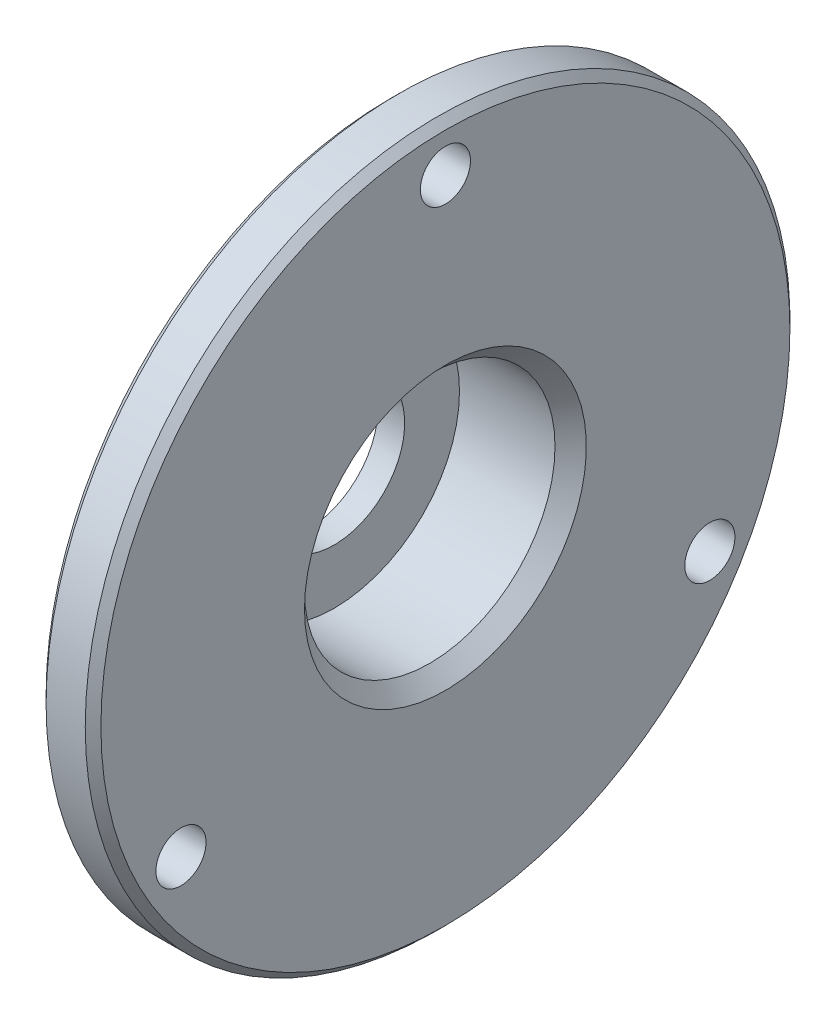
from build123d import *

# Parameters (mm, degrees)
ESQUISSE2_R                  = 1.6
ENL_V_MAT_EXTRU_1_DEPTH      = 34.014239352
R_P_TITION_CIRCULAIRE1_COUNT = 3
CHANFREIN1_SIZE              = 1
CHANFREIN2_SIZE              = 0.5


with BuildPart() as part:
    # Esquisse1 → Base-R_volution (revolve)
    with BuildSketch(Plane.XY, mode=Mode.PRIVATE) as base_r_volution_sk:
        Polygon((0, 4.5), (0, 12), (5.3, 12), (5.3, 22.5), (8.8, 22.5), (8.8, 8), (1.7, 8), (1.7, 4.5), align=None)
    revolve(base_r_volution_sk.sketch.rotate(Axis((0, 0, 0), (1, 0, 0)), 90), axis=Axis((0, 0, 0), (1, 0, 0)))

    # Esquisse2 → Enl_v. mat.-Extru.1 (cut, through all)
    with BuildSketch(Plane(origin=(8.8, 0, 0), x_dir=(0, 0, -1), z_dir=(1, 0, 0))):
        with Locations((0, 19.5)):
            Circle(ESQUISSE2_R)
    enl_v_mat_extru_1 = extrude(amount=-ENL_V_MAT_EXTRU_1_DEPTH, mode=Mode.SUBTRACT)

    # R_p_tition circulaire1: Enl_v. mat.-Extru.1 ×3 about axis
    r_p_tition_circulaire1_axis = Axis((0, 0, 0), (1, 0, 0))
    for i in range(1, R_P_TITION_CIRCULAIRE1_COUNT):
        add(enl_v_mat_extru_1.rotate(r_p_tition_circulaire1_axis, i * 360 / R_P_TITION_CIRCULAIRE1_COUNT), mode=Mode.SUBTRACT)

    # Chanfrein1
    chanfrein1_edges = [part.edges().sort_by_distance(p)[0] for p in [
        (8.8, 0, -8),
    ]]
    chamfer(chanfrein1_edges, length=CHANFREIN1_SIZE)

    # Chanfrein2
    chanfrein2_edges = [part.edges().sort_by_distance(p)[0] for p in [
        (8.8, 0, -22.5),
        (5.3, 0, -22.5),
        (0, 0, -12),
    ]]
    chamfer(chanfrein2_edges, length=CHANFREIN2_SIZE)


solid = part.part
